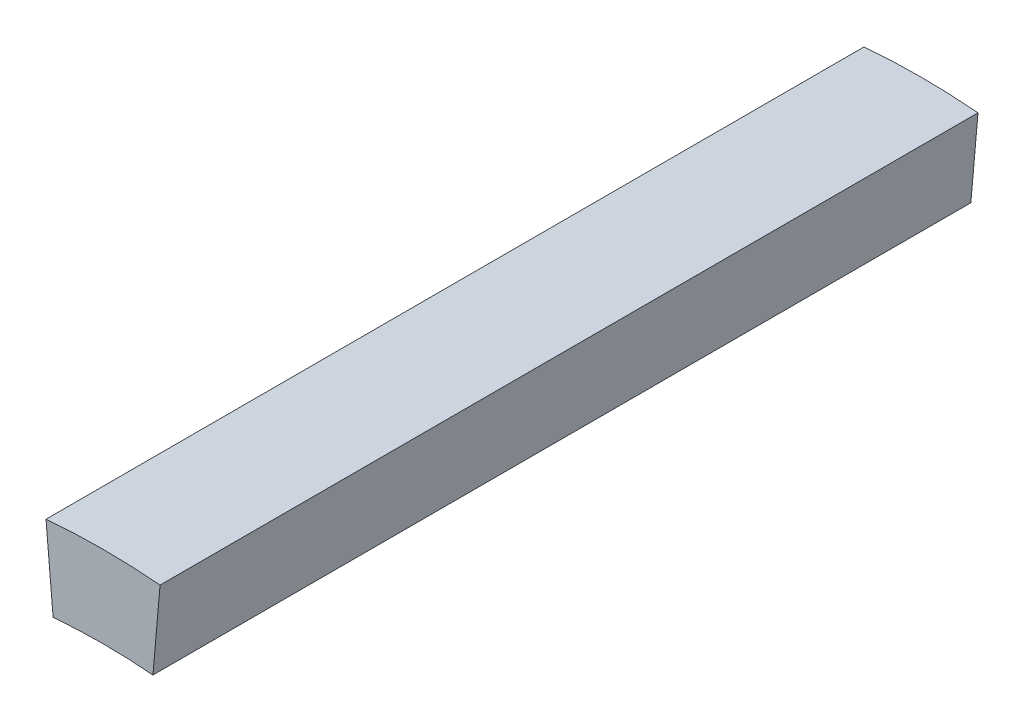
ISO-10303-21;
HEADER;
FILE_DESCRIPTION(('STEP AP214'),'2;1');
FILE_NAME('part.step','',(''),(''),'','','');
FILE_SCHEMA(('AUTOMOTIVE_DESIGN { 1 0 10303 214 1 1 1 1 }'));
ENDSEC;
DATA;
#1=APPLICATION_CONTEXT('core data for automotive mechanical design processes');
#2=APPLICATION_PROTOCOL_DEFINITION('international standard','automotive_design',2000,#1);
#3=PRODUCT_CONTEXT('',#1,'mechanical');
#4=PRODUCT('Part','Part','',(#3));
#5=PRODUCT_RELATED_PRODUCT_CATEGORY('part','',(#4));
#6=PRODUCT_DEFINITION_FORMATION('','',#4);
#7=PRODUCT_DEFINITION_CONTEXT('part definition',#1,'design');
#8=PRODUCT_DEFINITION('design','',#6,#7);
#9=PRODUCT_DEFINITION_SHAPE('','',#8);
#10=(LENGTH_UNIT() NAMED_UNIT(*) SI_UNIT(.MILLI.,.METRE.));
#11=(NAMED_UNIT(*) PLANE_ANGLE_UNIT() SI_UNIT($,.RADIAN.));
#12=(NAMED_UNIT(*) SI_UNIT($,.STERADIAN.) SOLID_ANGLE_UNIT());
#13=UNCERTAINTY_MEASURE_WITH_UNIT(LENGTH_MEASURE(1.E-05),#10,'distance_accuracy_value','');
#14=(GEOMETRIC_REPRESENTATION_CONTEXT(3) GLOBAL_UNCERTAINTY_ASSIGNED_CONTEXT((#13)) GLOBAL_UNIT_ASSIGNED_CONTEXT((#10,
#11,#12)) REPRESENTATION_CONTEXT('',''));
#15=CARTESIAN_POINT('',(0.,0.,0.));
#16=DIRECTION('',(0.,0.,1.));
#17=DIRECTION('',(1.,0.,0.));
#18=AXIS2_PLACEMENT_3D('',#15,#16,#17);
#19=CARTESIAN_POINT('',(0.,0.,10.));
#20=DIRECTION('',(0.,0.,-1.));
#21=DIRECTION('',(-1.,0.,0.));
#22=AXIS2_PLACEMENT_3D('',#19,#20,#21);
#23=CYLINDRICAL_SURFACE('',#22,7.);
#24=CARTESIAN_POINT('',(0.,0.,0.));
#25=DIRECTION('',(0.,0.,-1.));
#26=DIRECTION('',(-1.,0.,0.));
#27=AXIS2_PLACEMENT_3D('',#24,#25,#26);
#28=CIRCLE('',#27,7.);
#29=CARTESIAN_POINT('',(-0.610090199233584,6.97336288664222,0.));
#30=VERTEX_POINT('',#29);
#31=CARTESIAN_POINT('',(0.610090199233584,6.97336288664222,0.));
#32=VERTEX_POINT('',#31);
#33=EDGE_CURVE('E94',#30,#32,#28,.T.);
#34=ORIENTED_EDGE('',*,*,#33,.T.);
#35=DIRECTION('',(0.,0.,-1.));
#36=VECTOR('',#35,1.);
#37=CARTESIAN_POINT('',(0.610090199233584,6.97336288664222,10.));
#38=LINE('',#37,#36);
#39=CARTESIAN_POINT('',(0.610090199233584,6.97336288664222,10.));
#40=VERTEX_POINT('',#39);
#41=EDGE_CURVE('E11',#40,#32,#38,.T.);
#42=ORIENTED_EDGE('',*,*,#41,.F.);
#43=CARTESIAN_POINT('',(0.,0.,10.));
#44=DIRECTION('',(0.,0.,-1.));
#45=DIRECTION('',(-1.,0.,0.));
#46=AXIS2_PLACEMENT_3D('',#43,#44,#45);
#47=CIRCLE('',#46,7.);
#48=CARTESIAN_POINT('',(-0.610090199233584,6.97336288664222,10.));
#49=VERTEX_POINT('',#48);
#50=EDGE_CURVE('E82',#49,#40,#47,.T.);
#51=ORIENTED_EDGE('',*,*,#50,.F.);
#52=DIRECTION('',(0.,0.,-1.));
#53=VECTOR('',#52,1.);
#54=CARTESIAN_POINT('',(-0.610090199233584,6.97336288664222,10.));
#55=LINE('',#54,#53);
#56=EDGE_CURVE('E90',#49,#30,#55,.T.);
#57=ORIENTED_EDGE('',*,*,#56,.T.);
#58=EDGE_LOOP('',(#34,#42,#51,#57));
#59=FACE_BOUND('',#58,.T.);
#60=ADVANCED_FACE('F31',(#59),#23,.F.);
#61=CARTESIAN_POINT('',(0.697245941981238,7.96955758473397,10.));
#62=DIRECTION('',(-0.996194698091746,0.087155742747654,0.));
#63=DIRECTION('',(-0.087155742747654,-0.996194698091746,0.));
#64=AXIS2_PLACEMENT_3D('',#61,#62,#63);
#65=PLANE('',#64);
#66=DIRECTION('',(0.087155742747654,0.996194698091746,0.));
#67=VECTOR('',#66,1.);
#68=CARTESIAN_POINT('',(0.697245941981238,7.96955758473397,0.));
#69=LINE('',#68,#67);
#70=CARTESIAN_POINT('',(0.697245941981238,7.96955758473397,0.));
#71=VERTEX_POINT('',#70);
#72=EDGE_CURVE('E86',#32,#71,#69,.T.);
#73=ORIENTED_EDGE('',*,*,#72,.T.);
#74=DIRECTION('',(0.,0.,-1.));
#75=VECTOR('',#74,1.);
#76=CARTESIAN_POINT('',(0.697245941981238,7.96955758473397,10.));
#77=LINE('',#76,#75);
#78=CARTESIAN_POINT('',(0.697245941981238,7.96955758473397,10.));
#79=VERTEX_POINT('',#78);
#80=EDGE_CURVE('E39',#79,#71,#77,.T.);
#81=ORIENTED_EDGE('',*,*,#80,.F.);
#82=DIRECTION('',(0.087155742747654,0.996194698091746,0.));
#83=VECTOR('',#82,1.);
#84=CARTESIAN_POINT('',(0.697245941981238,7.96955758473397,10.));
#85=LINE('',#84,#83);
#86=EDGE_CURVE('E77',#40,#79,#85,.T.);
#87=ORIENTED_EDGE('',*,*,#86,.F.);
#88=ORIENTED_EDGE('',*,*,#41,.T.);
#89=EDGE_LOOP('',(#73,#81,#87,#88));
#90=FACE_BOUND('',#89,.T.);
#91=ADVANCED_FACE('F85',(#90),#65,.F.);
#92=CARTESIAN_POINT('',(0.,0.,10.));
#93=DIRECTION('',(0.,0.,-1.));
#94=DIRECTION('',(-1.,0.,0.));
#95=AXIS2_PLACEMENT_3D('',#92,#93,#94);
#96=CYLINDRICAL_SURFACE('',#95,8.);
#97=CARTESIAN_POINT('',(0.,0.,0.));
#98=DIRECTION('',(0.,0.,1.));
#99=DIRECTION('',(-1.,0.,0.));
#100=AXIS2_PLACEMENT_3D('',#97,#98,#99);
#101=CIRCLE('',#100,8.);
#102=CARTESIAN_POINT('',(-0.697245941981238,7.96955758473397,0.));
#103=VERTEX_POINT('',#102);
#104=EDGE_CURVE('E64',#71,#103,#101,.T.);
#105=ORIENTED_EDGE('',*,*,#104,.T.);
#106=DIRECTION('',(0.,0.,-1.));
#107=VECTOR('',#106,1.);
#108=CARTESIAN_POINT('',(-0.697245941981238,7.96955758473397,10.));
#109=LINE('',#108,#107);
#110=CARTESIAN_POINT('',(-0.697245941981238,7.96955758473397,10.));
#111=VERTEX_POINT('',#110);
#112=EDGE_CURVE('E87',#111,#103,#109,.T.);
#113=ORIENTED_EDGE('',*,*,#112,.F.);
#114=CARTESIAN_POINT('',(0.,0.,10.));
#115=DIRECTION('',(0.,0.,1.));
#116=DIRECTION('',(-1.,0.,0.));
#117=AXIS2_PLACEMENT_3D('',#114,#115,#116);
#118=CIRCLE('',#117,8.);
#119=EDGE_CURVE('E80',#79,#111,#118,.T.);
#120=ORIENTED_EDGE('',*,*,#119,.F.);
#121=ORIENTED_EDGE('',*,*,#80,.T.);
#122=EDGE_LOOP('',(#105,#113,#120,#121));
#123=FACE_BOUND('',#122,.T.);
#124=ADVANCED_FACE('F88',(#123),#96,.T.);
#125=CARTESIAN_POINT('',(-0.610090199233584,6.97336288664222,10.));
#126=DIRECTION('',(0.996194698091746,0.087155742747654,0.));
#127=DIRECTION('',(-0.087155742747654,0.996194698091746,0.));
#128=AXIS2_PLACEMENT_3D('',#125,#126,#127);
#129=PLANE('',#128);
#130=DIRECTION('',(0.087155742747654,-0.996194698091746,0.));
#131=VECTOR('',#130,1.);
#132=CARTESIAN_POINT('',(-0.610090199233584,6.97336288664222,0.));
#133=LINE('',#132,#131);
#134=EDGE_CURVE('E70',#103,#30,#133,.T.);
#135=ORIENTED_EDGE('',*,*,#134,.T.);
#136=ORIENTED_EDGE('',*,*,#56,.F.);
#137=DIRECTION('',(0.087155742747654,-0.996194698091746,0.));
#138=VECTOR('',#137,1.);
#139=CARTESIAN_POINT('',(-0.610090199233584,6.97336288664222,10.));
#140=LINE('',#139,#138);
#141=EDGE_CURVE('E47',#111,#49,#140,.T.);
#142=ORIENTED_EDGE('',*,*,#141,.F.);
#143=ORIENTED_EDGE('',*,*,#112,.T.);
#144=EDGE_LOOP('',(#135,#136,#142,#143));
#145=FACE_BOUND('',#144,.T.);
#146=ADVANCED_FACE('F101',(#145),#129,.F.);
#147=CARTESIAN_POINT('',(0.,0.,10.));
#148=DIRECTION('',(0.,0.,-1.));
#149=DIRECTION('',(-1.,0.,0.));
#150=AXIS2_PLACEMENT_3D('',#147,#148,#149);
#151=PLANE('',#150);
#152=ORIENTED_EDGE('',*,*,#50,.T.);
#153=ORIENTED_EDGE('',*,*,#86,.T.);
#154=ORIENTED_EDGE('',*,*,#119,.T.);
#155=ORIENTED_EDGE('',*,*,#141,.T.);
#156=EDGE_LOOP('',(#152,#153,#154,#155));
#157=FACE_BOUND('',#156,.T.);
#158=ADVANCED_FACE('F78',(#157),#151,.F.);
#159=CARTESIAN_POINT('',(0.,0.,0.));
#160=DIRECTION('',(0.,0.,-1.));
#161=DIRECTION('',(-1.,0.,0.));
#162=AXIS2_PLACEMENT_3D('',#159,#160,#161);
#163=PLANE('',#162);
#164=ORIENTED_EDGE('',*,*,#33,.F.);
#165=ORIENTED_EDGE('',*,*,#134,.F.);
#166=ORIENTED_EDGE('',*,*,#104,.F.);
#167=ORIENTED_EDGE('',*,*,#72,.F.);
#168=EDGE_LOOP('',(#164,#165,#166,#167));
#169=FACE_BOUND('',#168,.T.);
#170=ADVANCED_FACE('F104',(#169),#163,.T.);
#171=CLOSED_SHELL('',(#60,#91,#124,#146,#158,#170));
#172=MANIFOLD_SOLID_BREP('B2',#171);
#173=ADVANCED_BREP_SHAPE_REPRESENTATION('',(#18,#172),#14);
#174=SHAPE_DEFINITION_REPRESENTATION(#9,#173);
ENDSEC;
END-ISO-10303-21;
